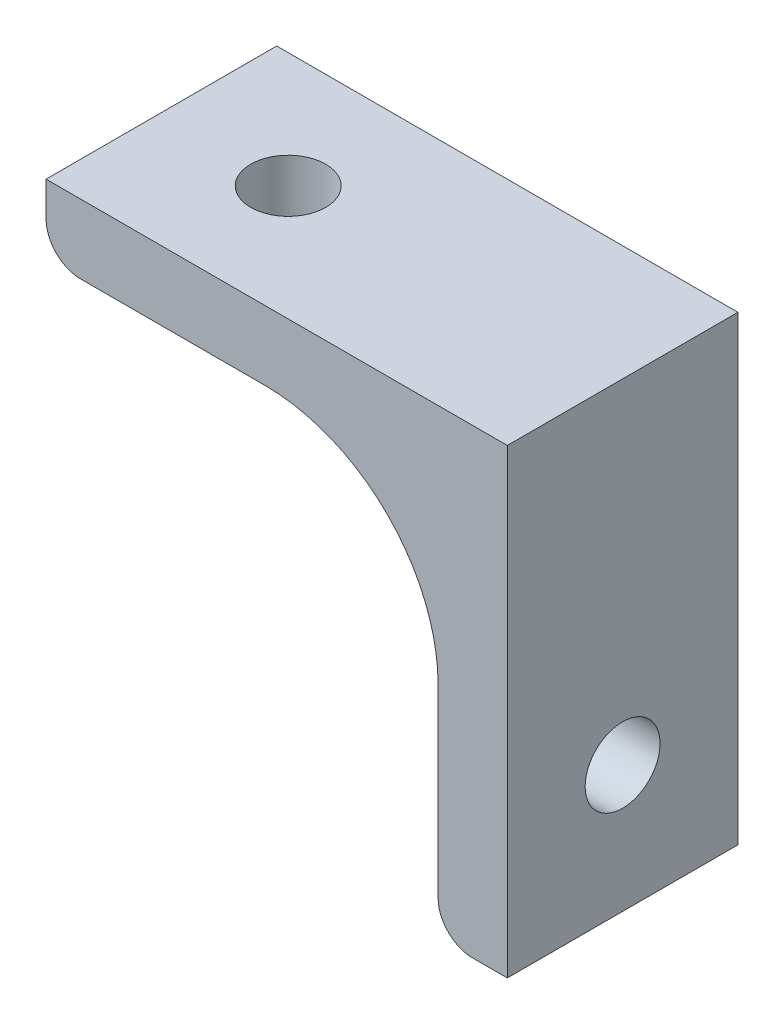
from build123d import *

# Parameters (mm, degrees)
EXTRUIR1_DEPTH        = 20
CROQUIS3_R            = 3.25
CORTAR_EXTRUIR1_DEPTH = 10
CROQUIS4_R            = 3.25
CORTAR_EXTRUIR2_DEPTH = 10


with BuildPart() as part:
    # Croquis2 → Extruir1 (new body)
    with BuildSketch(Plane.XY):
        with BuildLine():
            Line((0, 0), (-40, 0))
            Line((-40, 0), (-40, -3))
            ThreePointArc((-40, -3), (-39.121320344, -5.121320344), (-37, -6))
            Line((-37, -6), (-21, -6))
            ThreePointArc((-21, -6), (-10.393398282, -10.393398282), (-6, -21))
            Line((-6, -21), (-6, -37))
            ThreePointArc((-6, -37), (-5.121320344, -39.121320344), (-3, -40))
            Line((-3, -40), (0, -40))
            Line((0, -40), (0, 0))
        make_face()
    extrude(amount=EXTRUIR1_DEPTH)

    # Croquis3 → Cortar-Extruir1 (cut)
    with BuildSketch(Plane.XZ.offset(6)):
        with Locations(Location((-29, 10, 0), (0, 0, 270))):
            Circle(CROQUIS3_R)
    extrude(amount=-CORTAR_EXTRUIR1_DEPTH, mode=Mode.SUBTRACT)

    # Croquis4 → Cortar-Extruir2 (cut)
    with BuildSketch(Plane.ZY.offset(6)):
        with Locations((10, -29)):
            Circle(CROQUIS4_R)
    extrude(amount=-CORTAR_EXTRUIR2_DEPTH, mode=Mode.SUBTRACT)


solid = part.part
